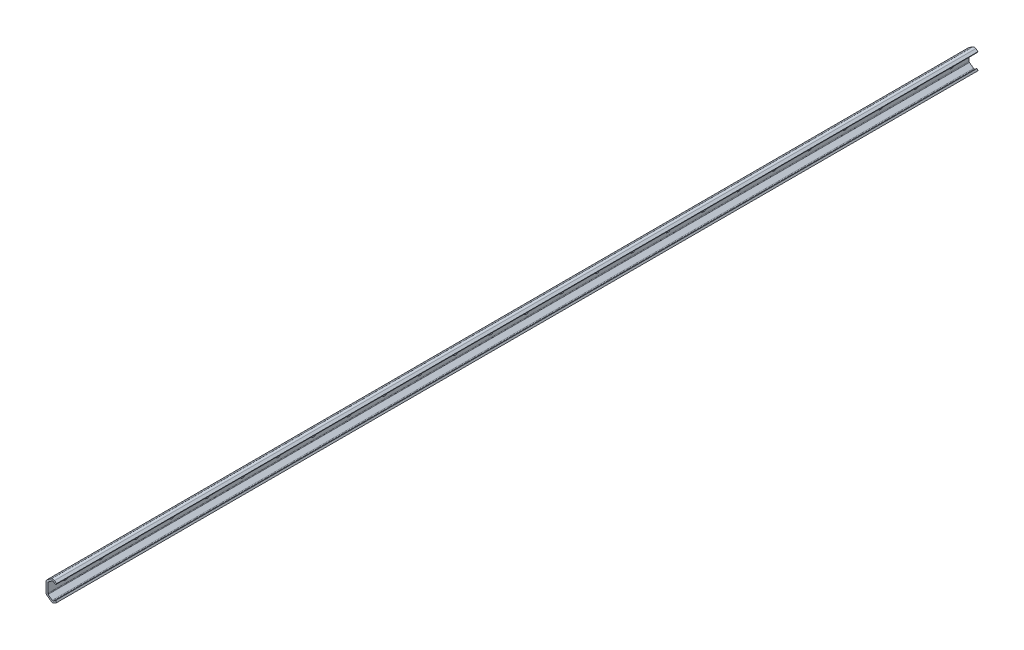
from build123d import *

# Parameters (mm, degrees)
EXTRUDE1_DEPTH  = 2080
EXTRUDE2_DEPTH  = 2081.226295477
LPATTERN1_COUNT = 26
LPATTERN1_PITCH = 80


with BuildPart() as part:
    # Sketch1 → Extrude1 (new body)
    with BuildSketch(Plane.XY):
        with BuildLine():
            Line((21.705694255, -15.401627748), (24, -18.678235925))
            Line((24, -18.678235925), (19.036236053, -22.153900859))
            ThreePointArc((19.036236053, -22.153900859), (15.5, -23.268871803), (11.963763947, -22.153900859))
            Line((11.963763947, -22.153900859), (3.371852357, -16.137779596))
            ThreePointArc((3.371852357, -16.137779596), (0.906121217, -13.750365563), (0, -10.44))
            Line((0, -10.44), (0, 10.44))
            ThreePointArc((0, 10.44), (0.906121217, 13.750365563), (3.371852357, 16.137779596))
            Line((3.371852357, 16.137779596), (11.963763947, 22.153900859))
            ThreePointArc((11.963763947, 22.153900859), (15.5, 23.268871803), (19.036236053, 22.153900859))
            Line((19.036236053, 22.153900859), (24, 18.678235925))
            Line((24, 18.678235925), (21.705694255, 15.401627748))
            Line((21.705694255, 15.401627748), (16.813992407, 18.826834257))
            ThreePointArc((16.813992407, 18.826834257), (15.5, 19.241134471), (14.186007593, 18.826834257))
            Line((14.186007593, 18.826834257), (4.730448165, 12.205980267))
            ThreePointArc((4.730448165, 12.205980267), (4.107613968, 11.429543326), (4, 10.44))
            Line((4, 10.44), (4, -10.44))
            ThreePointArc((4, -10.44), (4.189818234, -11.395541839), (4.730448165, -12.205980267))
            Line((4.730448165, -12.205980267), (14.186007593, -18.826834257))
            ThreePointArc((14.186007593, -18.826834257), (15.5, -19.241134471), (16.813992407, -18.826834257))
            Line((16.813992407, -18.826834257), (21.705694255, -15.401627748))
        make_face()
    extrude(amount=-EXTRUDE1_DEPTH)

    # Sketch2 → Extrude2 (cut, through all)
    with BuildSketch(Plane(origin=(4, 0, 0), x_dir=(0, 0, -1), z_dir=(1, 0, 0))):
        with BuildLine():
            Line((39, 4.5), (41, 4.5))
            ThreePointArc((41, 4.5), (45.5, 0), (41, -4.5))
            Line((41, -4.5), (39, -4.5))
            ThreePointArc((39, -4.5), (34.5, 0), (39, 4.5))
        make_face()
    extrude2 = extrude(amount=-EXTRUDE2_DEPTH, mode=Mode.SUBTRACT)

    # LPattern1: Extrude2 ×26
    with Locations(*[(0, 0, -i * LPATTERN1_PITCH) for i in range(1, LPATTERN1_COUNT)]):
        add(extrude2, mode=Mode.SUBTRACT)


solid = part.part
